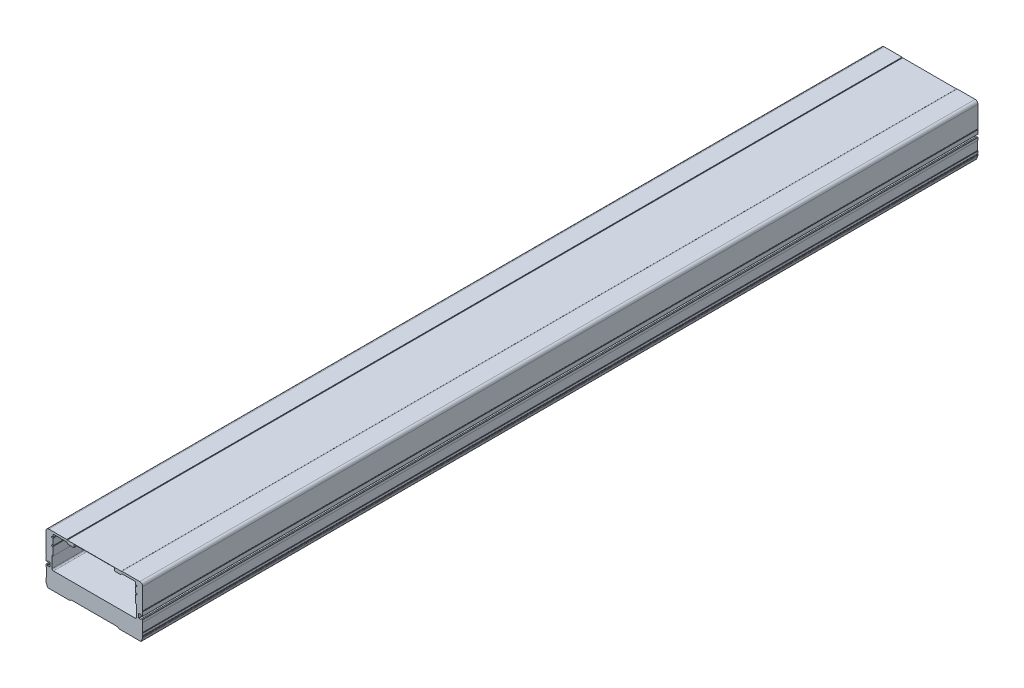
from build123d import *

# Parameters (mm, degrees)
EXTRUDE_1_DEPTH      = 1167
HOLE_WIZARD_M6_D     = 5
HOLE_WIZARD_M6_DEPTH = 15
HOLE_WIZARD_M6_TIP   = 1.502151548


with BuildPart() as part:
    # Sketch 1 → Extrude 1 (new body)
    with BuildSketch(Plane.XY):
        with BuildLine():
            Line((-67.5, 66.1), (-67.5, 36.604669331))
            ThreePointArc((-67.5, 36.604669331), (-67.454950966, 36.446555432), (-67.3333333, 36.33592739))
            ThreePointArc((-67.3333333, 36.33592739), (-67.125, 35.999999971), (-67.333333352, 35.664072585))
            ThreePointArc((-67.333333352, 35.664072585), (-67.454950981, 35.553444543), (-67.5, 35.395330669))
            Line((-67.5, 35.395330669), (-67.5, 30.1))
            ThreePointArc((-67.5, 30.1), (-67.412132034, 29.887867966), (-67.2, 29.8))
            Line((-67.2, 29.8), (-65.8, 29.8))
            ThreePointArc((-65.8, 29.8), (-65.587867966, 29.887867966), (-65.5, 30.1))
            Line((-65.5, 30.1), (-65.5, 30.7))
            ThreePointArc((-65.5, 30.7), (-65.412132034, 30.912132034), (-65.2, 31))
            Line((-65.2, 31), (-62.3, 31))
            ThreePointArc((-62.3, 31), (-62.087867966, 30.912132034), (-62, 30.7))
            Line((-62, 30.7), (-62, 25.3))
            ThreePointArc((-62, 25.3), (-62.087867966, 25.087867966), (-62.3, 25))
            Line((-62.3, 25), (-65.2, 25))
            ThreePointArc((-65.2, 25), (-65.412132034, 25.087867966), (-65.5, 25.3))
            Line((-65.5, 25.3), (-65.5, 25.9))
            ThreePointArc((-65.5, 25.9), (-65.587867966, 26.112132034), (-65.8, 26.2))
            Line((-65.8, 26.2), (-67.2, 26.2))
            ThreePointArc((-67.2, 26.2), (-67.412132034, 26.112132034), (-67.5, 25.9))
            Line((-67.5, 25.9), (-67.5, 22.5))
            Line((-67.5, 22.5), (-67, 22))
            Line((-67, 22), (-67, 10))
            Line((-67, 10), (-67.5, 9.5))
            Line((-67.5, 9.5), (-67.5, 6.604669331))
            ThreePointArc((-67.5, 6.604669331), (-67.454950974, 6.446555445), (-67.333333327, 6.335927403))
            ThreePointArc((-67.333333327, 6.335927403), (-67.125, 5.999999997), (-67.333333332, 5.664072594))
            ThreePointArc((-67.333333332, 5.664072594), (-67.454950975, 5.553444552), (-67.5, 5.395330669))
            Line((-67.5, 5.395330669), (-67.5, 4.381968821))
            ThreePointArc((-67.5, 4.381968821), (-67.464493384, 4.00678121), (-67.359234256, 3.644915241))
            Line((-67.359234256, 3.644915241), (-65.506419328, -1.028852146))
            ThreePointArc((-65.506419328, -1.028852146), (-65.35722349, -1.328991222), (-65.16, -1.6))
            Line((-65.16, -1.6), (-34.1, -1.6))
            Line((-34.1, -1.6), (-32.5, 0))
            Line((-32.5, 0), (32.5, 0))
            Line((32.5, 0), (34.1, -1.6))
            Line((34.1, -1.6), (65.16, -1.6))
            ThreePointArc((65.16, -1.6), (65.35722349, -1.328991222), (65.506419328, -1.028852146))
            Line((65.506419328, -1.028852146), (67.359234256, 3.644915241))
            ThreePointArc((67.359234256, 3.644915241), (67.464493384, 4.00678121), (67.5, 4.381968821))
            Line((67.5, 4.381968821), (67.5, 5.395330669))
            ThreePointArc((67.5, 5.395330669), (67.454950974, 5.553444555), (67.333333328, 5.664072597))
            ThreePointArc((67.333333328, 5.664072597), (67.125, 6.000000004), (67.333333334, 6.335927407))
            ThreePointArc((67.333333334, 6.335927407), (67.454950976, 6.446555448), (67.5, 6.604669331))
            Line((67.5, 6.604669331), (67.5, 9.5))
            Line((67.5, 9.5), (67, 10))
            Line((67, 10), (67, 22))
            Line((67, 22), (67.5, 22.5))
            Line((67.5, 22.5), (67.5, 25.9))
            ThreePointArc((67.5, 25.9), (67.412132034, 26.112132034), (67.2, 26.2))
            Line((67.2, 26.2), (65.8, 26.2))
            ThreePointArc((65.8, 26.2), (65.587867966, 26.112132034), (65.5, 25.9))
            Line((65.5, 25.9), (65.5, 25.3))
            ThreePointArc((65.5, 25.3), (65.412132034, 25.087867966), (65.2, 25))
            Line((65.2, 25), (62.3, 25))
            ThreePointArc((62.3, 25), (62.087867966, 25.087867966), (62, 25.3))
            Line((62, 25.3), (62, 30.7))
            ThreePointArc((62, 30.7), (62.087867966, 30.912132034), (62.3, 31))
            Line((62.3, 31), (65.2, 31))
            ThreePointArc((65.2, 31), (65.412132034, 30.912132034), (65.5, 30.7))
            Line((65.5, 30.7), (65.5, 30.1))
            ThreePointArc((65.5, 30.1), (65.587867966, 29.887867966), (65.8, 29.8))
            Line((65.8, 29.8), (67.2, 29.8))
            ThreePointArc((67.2, 29.8), (67.412132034, 29.887867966), (67.5, 30.1))
            Line((67.5, 30.1), (67.5, 35.395330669))
            ThreePointArc((67.5, 35.395330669), (67.454950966, 35.553444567), (67.333333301, 35.66407261))
            ThreePointArc((67.333333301, 35.66407261), (67.125, 36.000000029), (67.333333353, 36.335927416))
            ThreePointArc((67.333333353, 36.335927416), (67.454950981, 36.446555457), (67.5, 36.604669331))
            Line((67.5, 36.604669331), (67.5, 66.1))
            ThreePointArc((67.5, 66.1), (66.328427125, 68.928427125), (63.5, 70.1))
            Line((63.5, 70.1), (38.5, 70.1))
            Line((38.5, 70.1), (38, 69.6))
            Line((38, 69.6), (37.5, 69.6))
            Line((37.5, 69.6), (37.5, 69.7))
            Line((37.5, 69.7), (-37.5, 69.7))
            Line((-37.5, 69.7), (-37.5, 69.6))
            Line((-37.5, 69.6), (-38, 69.6))
            Line((-38, 69.6), (-38.5, 70.1))
            Line((-38.5, 70.1), (-63.5, 70.1))
            ThreePointArc((-63.5, 70.1), (-66.328427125, 68.928427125), (-67.5, 66.1))
        make_face()
        with BuildLine():
            Line((-57, 22.7), (57, 22.7))
            ThreePointArc((57, 22.7), (58.414213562, 23.285786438), (59, 24.7))
            Line((59, 24.7), (59, 40.6))
            Line((59, 40.6), (57.5, 40.6))
            Line((57.5, 40.6), (57.5, 52.141742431))
            ThreePointArc((57.5, 52.141742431), (59.6, 52.6), (57.5, 53.058257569))
            Line((57.5, 53.058257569), (57.5, 62.141742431))
            ThreePointArc((57.5, 62.141742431), (59.6, 62.6), (57.5, 63.058257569))
            Line((57.5, 63.058257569), (57.5, 66.1))
            ThreePointArc((57.5, 66.1), (57.207106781, 66.807106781), (56.5, 67.1))
            Line((56.5, 67.1), (38.5, 67.1))
            Line((38.5, 67.1), (36.5, 65.1))
            Line((36.5, 65.1), (28.8, 65.1))
            ThreePointArc((28.8, 65.1), (28.587867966, 65.187867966), (28.5, 65.4))
            Line((28.5, 65.4), (28.5, 69.3))
            Line((28.5, 69.3), (-28.5, 69.3))
            Line((-28.5, 69.3), (-28.5, 65.4))
            ThreePointArc((-28.5, 65.4), (-28.587867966, 65.187867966), (-28.8, 65.1))
            Line((-28.8, 65.1), (-36.5, 65.1))
            Line((-36.5, 65.1), (-38.5, 67.1))
            Line((-38.5, 67.1), (-56.5, 67.1))
            ThreePointArc((-56.5, 67.1), (-57.207106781, 66.807106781), (-57.5, 66.1))
            Line((-57.5, 66.1), (-57.5, 63.058257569))
            ThreePointArc((-57.5, 63.058257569), (-59.6, 62.6), (-57.5, 62.141742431))
            Line((-57.5, 62.141742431), (-57.5, 53.058257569))
            ThreePointArc((-57.5, 53.058257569), (-59.6, 52.6), (-57.5, 52.141742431))
            Line((-57.5, 52.141742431), (-57.5, 40.6))
            Line((-57.5, 40.6), (-59.3, 40.6))
            ThreePointArc((-59.3, 40.6), (-59.087867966, 40.512132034), (-59, 40.3))
            Line((-59, 40.3), (-59, 24.7))
            ThreePointArc((-59, 24.7), (-58.414213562, 23.285786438), (-57, 22.7))
        make_face(mode=Mode.SUBTRACT)
    extrude(amount=-EXTRUDE_1_DEPTH)

    # Hole Wizard M6
    with Locations(Plane(origin=(0, -1.6, 0), x_dir=(-1, 0, 0), z_dir=(0, -1, 0))):
        with Locations((53, 1115.5), (-53, 1115.5), (53, 1065.5), (-53, 1065.5), (-53, 865.5), (53, 865.5), (-53, 665.5), (53, 665.5), (-53, 465.5), (53, 465.5), (-53, 265.5), (53, 265.5), (53, 65.5), (-53, 65.5)):
            Hole(HOLE_WIZARD_M6_D / 2, depth=HOLE_WIZARD_M6_DEPTH)
            with Locations((0, 0, -(HOLE_WIZARD_M6_DEPTH + HOLE_WIZARD_M6_TIP / 2))):  # 118° drill point
                Cone(0, HOLE_WIZARD_M6_D / 2, HOLE_WIZARD_M6_TIP, mode=Mode.SUBTRACT)


solid = part.part
